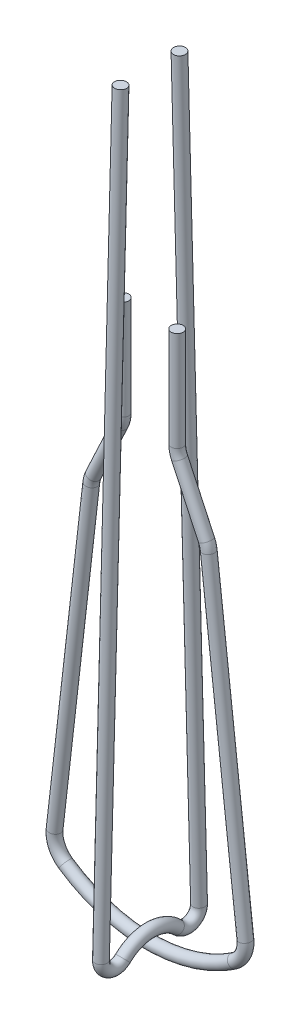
ISO-10303-21;
HEADER;
FILE_DESCRIPTION(('STEP AP214'),'2;1');
FILE_NAME('part.step','',(''),(''),'','','');
FILE_SCHEMA(('AUTOMOTIVE_DESIGN { 1 0 10303 214 1 1 1 1 }'));
ENDSEC;
DATA;
#1=APPLICATION_CONTEXT('core data for automotive mechanical design processes');
#2=APPLICATION_PROTOCOL_DEFINITION('international standard','automotive_design',2000,#1);
#3=PRODUCT_CONTEXT('',#1,'mechanical');
#4=PRODUCT('Part','Part','',(#3));
#5=PRODUCT_RELATED_PRODUCT_CATEGORY('part','',(#4));
#6=PRODUCT_DEFINITION_FORMATION('','',#4);
#7=PRODUCT_DEFINITION_CONTEXT('part definition',#1,'design');
#8=PRODUCT_DEFINITION('design','',#6,#7);
#9=PRODUCT_DEFINITION_SHAPE('','',#8);
#10=(LENGTH_UNIT() NAMED_UNIT(*) SI_UNIT(.MILLI.,.METRE.));
#11=(NAMED_UNIT(*) PLANE_ANGLE_UNIT() SI_UNIT($,.RADIAN.));
#12=(NAMED_UNIT(*) SI_UNIT($,.STERADIAN.) SOLID_ANGLE_UNIT());
#13=UNCERTAINTY_MEASURE_WITH_UNIT(LENGTH_MEASURE(1.E-05),#10,'distance_accuracy_value','');
#14=(GEOMETRIC_REPRESENTATION_CONTEXT(3) GLOBAL_UNCERTAINTY_ASSIGNED_CONTEXT((#13)) GLOBAL_UNIT_ASSIGNED_CONTEXT((#10,
#11,#12)) REPRESENTATION_CONTEXT('',''));
#15=CARTESIAN_POINT('',(0.,0.,0.));
#16=DIRECTION('',(0.,0.,1.));
#17=DIRECTION('',(1.,0.,0.));
#18=AXIS2_PLACEMENT_3D('',#15,#16,#17);
#19=CARTESIAN_POINT('',(6.66749999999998,-5.11109615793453,0.));
#20=DIRECTION('',(0.,1.,0.));
#21=DIRECTION('',(-1.,0.,0.));
#22=AXIS2_PLACEMENT_3D('',#19,#20,#21);
#23=CYLINDRICAL_SURFACE('',#22,1.4605);
#24=CARTESIAN_POINT('',(6.66749999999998,-5.11109615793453,0.));
#25=DIRECTION('',(0.,1.,0.));
#26=DIRECTION('',(-1.,0.,0.));
#27=AXIS2_PLACEMENT_3D('',#24,#25,#26);
#28=CIRCLE('',#27,1.4605);
#29=CARTESIAN_POINT('',(5.20699999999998,-5.11109615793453,0.));
#30=VERTEX_POINT('',#29);
#31=EDGE_CURVE('E49',#30,#30,#28,.T.);
#32=ORIENTED_EDGE('',*,*,#31,.T.);
#33=EDGE_LOOP('',(#32));
#34=FACE_BOUND('',#33,.T.);
#35=CARTESIAN_POINT('',(6.66749999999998,19.2995920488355,0.));
#36=DIRECTION('',(0.,1.,0.));
#37=DIRECTION('',(-1.,0.,0.));
#38=AXIS2_PLACEMENT_3D('',#35,#36,#37);
#39=CIRCLE('',#38,1.4605);
#40=CARTESIAN_POINT('',(5.20699999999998,19.2995920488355,0.));
#41=VERTEX_POINT('',#40);
#42=EDGE_CURVE('E45',#41,#41,#39,.T.);
#43=ORIENTED_EDGE('',*,*,#42,.F.);
#44=EDGE_LOOP('',(#43));
#45=FACE_BOUND('',#44,.T.);
#46=ADVANCED_FACE('F35',(#34,#45),#23,.T.);
#47=CARTESIAN_POINT('',(13.0175,-5.11109615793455,0.));
#48=DIRECTION('',(0.,0.,-1.));
#49=DIRECTION('',(-1.,0.,0.));
#50=AXIS2_PLACEMENT_3D('',#47,#48,#49);
#51=TOROIDAL_SURFACE('',#50,6.35000000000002,1.4605);
#52=CARTESIAN_POINT('',(7.26244555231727,-7.79472211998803,0.));
#53=DIRECTION('',(-0.422618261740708,0.906307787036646,0.));
#54=DIRECTION('',(-0.906307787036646,-0.422618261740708,0.));
#55=AXIS2_PLACEMENT_3D('',#52,#53,#54);
#56=CIRCLE('',#55,1.4605);
#57=CARTESIAN_POINT('',(5.93878302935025,-8.41195609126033,0.));
#58=VERTEX_POINT('',#57);
#59=EDGE_CURVE('E53',#58,#58,#56,.T.);
#60=CARTESIAN_POINT('',(13.0175,-5.11109615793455,0.));
#61=DIRECTION('',(0.,0.,-1.));
#62=DIRECTION('',(-1.,0.,0.));
#63=AXIS2_PLACEMENT_3D('',#60,#61,#62);
#64=CIRCLE('',#63,7.81050000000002);
#65=EDGE_CURVE('',#58,#30,#64,.T.);
#66=ORIENTED_EDGE('',*,*,#59,.T.);
#67=ORIENTED_EDGE('',*,*,#31,.F.);
#68=ORIENTED_EDGE('',*,*,#65,.T.);
#69=ORIENTED_EDGE('',*,*,#65,.F.);
#70=EDGE_LOOP('',(#66,#68,#67,#69));
#71=FACE_BOUND('',#70,.T.);
#72=ADVANCED_FACE('F122',(#71),#51,.T.);
#73=CARTESIAN_POINT('',(13.8521167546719,-21.9263176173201,0.));
#74=DIRECTION('',(-0.422618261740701,0.906307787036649,0.));
#75=DIRECTION('',(-0.906307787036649,-0.422618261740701,0.));
#76=AXIS2_PLACEMENT_3D('',#73,#74,#75);
#77=CYLINDRICAL_SURFACE('',#76,1.4605);
#78=CARTESIAN_POINT('',(13.8521167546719,-21.9263176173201,0.));
#79=DIRECTION('',(-0.422618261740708,0.906307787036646,0.));
#80=DIRECTION('',(-0.906307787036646,-0.422618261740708,0.));
#81=AXIS2_PLACEMENT_3D('',#78,#79,#80);
#82=CIRCLE('',#81,1.4605);
#83=CARTESIAN_POINT('',(15.1757792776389,-21.3090836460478,0.));
#84=VERTEX_POINT('',#83);
#85=EDGE_CURVE('E58',#84,#84,#82,.T.);
#86=ORIENTED_EDGE('',*,*,#85,.T.);
#87=EDGE_LOOP('',(#86));
#88=FACE_BOUND('',#87,.T.);
#89=ORIENTED_EDGE('',*,*,#59,.F.);
#90=EDGE_LOOP('',(#89));
#91=FACE_BOUND('',#90,.T.);
#92=ADVANCED_FACE('F127',(#88,#91),#77,.T.);
#93=CARTESIAN_POINT('',(8.09706230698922,-24.6099435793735,0.));
#94=DIRECTION('',(0.,0.,1.));
#95=DIRECTION('',(1.,0.,0.));
#96=AXIS2_PLACEMENT_3D('',#93,#94,#95);
#97=TOROIDAL_SURFACE('',#96,6.34999999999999,1.4605);
#98=CARTESIAN_POINT('',(14.4053657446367,-23.8834398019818,0.));
#99=DIRECTION('',(-0.114410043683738,0.993433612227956,0.));
#100=DIRECTION('',(-0.993433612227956,-0.114410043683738,0.));
#101=AXIS2_PLACEMENT_3D('',#98,#99,#100);
#102=CIRCLE('',#101,1.4605);
#103=CARTESIAN_POINT('',(15.8562755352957,-23.7163439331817,0.));
#104=VERTEX_POINT('',#103);
#105=EDGE_CURVE('E61',#104,#104,#102,.T.);
#106=CARTESIAN_POINT('',(8.09706230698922,-24.6099435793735,0.));
#107=DIRECTION('',(0.,0.,1.));
#108=DIRECTION('',(1.,0.,0.));
#109=AXIS2_PLACEMENT_3D('',#106,#107,#108);
#110=CIRCLE('',#109,7.81049999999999);
#111=EDGE_CURVE('',#104,#84,#110,.T.);
#112=ORIENTED_EDGE('',*,*,#105,.T.);
#113=ORIENTED_EDGE('',*,*,#85,.F.);
#114=ORIENTED_EDGE('',*,*,#111,.T.);
#115=ORIENTED_EDGE('',*,*,#111,.F.);
#116=EDGE_LOOP('',(#112,#114,#113,#115));
#117=FACE_BOUND('',#116,.T.);
#118=ADVANCED_FACE('F135',(#117),#97,.T.);
#119=CARTESIAN_POINT('',(23.3995437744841,-101.980768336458,0.));
#120=DIRECTION('',(-0.114410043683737,0.993433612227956,0.));
#121=DIRECTION('',(-0.993433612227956,-0.114410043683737,0.));
#122=AXIS2_PLACEMENT_3D('',#119,#120,#121);
#123=CYLINDRICAL_SURFACE('',#122,1.4605);
#124=CARTESIAN_POINT('',(23.3995437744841,-101.980768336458,0.));
#125=DIRECTION('',(-0.114410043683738,0.993433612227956,0.));
#126=DIRECTION('',(-0.993433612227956,-0.114410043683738,0.));
#127=AXIS2_PLACEMENT_3D('',#124,#125,#126);
#128=CIRCLE('',#127,1.4605);
#129=CARTESIAN_POINT('',(24.850453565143,-101.813672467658,0.));
#130=VERTEX_POINT('',#129);
#131=EDGE_CURVE('E64',#130,#130,#128,.T.);
#132=ORIENTED_EDGE('',*,*,#131,.T.);
#133=EDGE_LOOP('',(#132));
#134=FACE_BOUND('',#133,.T.);
#135=ORIENTED_EDGE('',*,*,#105,.F.);
#136=EDGE_LOOP('',(#135));
#137=FACE_BOUND('',#136,.T.);
#138=ADVANCED_FACE('F141',(#134,#137),#123,.T.);
#139=CARTESIAN_POINT('',(17.0912403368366,-102.70727211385,0.));
#140=DIRECTION('',(0.,0.,1.));
#141=DIRECTION('',(1.,0.,0.));
#142=AXIS2_PLACEMENT_3D('',#139,#140,#141);
#143=TOROIDAL_SURFACE('',#142,6.35,1.4605);
#144=CARTESIAN_POINT('',(20.6519154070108,-107.965037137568,0.));
#145=DIRECTION('',(0.8279944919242,0.560736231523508,0.));
#146=DIRECTION('',(-0.560736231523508,0.8279944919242,0.));
#147=AXIS2_PLACEMENT_3D('',#144,#145,#146);
#148=CIRCLE('',#147,1.4605);
#149=CARTESIAN_POINT('',(21.4708706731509,-109.174323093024,0.));
#150=VERTEX_POINT('',#149);
#151=EDGE_CURVE('E67',#150,#150,#148,.T.);
#152=CARTESIAN_POINT('',(17.0912403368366,-102.70727211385,0.));
#153=DIRECTION('',(0.,0.,1.));
#154=DIRECTION('',(1.,0.,0.));
#155=AXIS2_PLACEMENT_3D('',#152,#153,#154);
#156=CIRCLE('',#155,7.8105);
#157=EDGE_CURVE('',#150,#130,#156,.T.);
#158=ORIENTED_EDGE('',*,*,#151,.T.);
#159=ORIENTED_EDGE('',*,*,#131,.F.);
#160=ORIENTED_EDGE('',*,*,#157,.T.);
#161=ORIENTED_EDGE('',*,*,#157,.F.);
#162=EDGE_LOOP('',(#158,#160,#159,#161));
#163=FACE_BOUND('',#162,.T.);
#164=ADVANCED_FACE('F145',(#163),#143,.T.);
#165=CARTESIAN_POINT('',(0.,-77.47,0.));
#166=DIRECTION('',(0.,0.,1.));
#167=DIRECTION('',(1.,0.,0.));
#168=AXIS2_PLACEMENT_3D('',#165,#166,#167);
#169=TOROIDAL_SURFACE('',#168,36.83,1.4605);
#170=CARTESIAN_POINT('',(-0.651045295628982,-113.11229995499,-0.858205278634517));
#171=CARTESIAN_POINT('',(-0.69147082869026,-113.088762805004,-0.826812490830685));
#172=CARTESIAN_POINT('',(-0.72846681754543,-113.064384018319,-0.791627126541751));
#173=CARTESIAN_POINT('',(-0.795055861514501,-113.016457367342,-0.71436035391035));
#174=CARTESIAN_POINT('',(-0.824646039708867,-112.992909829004,-0.67227627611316));
#175=CARTESIAN_POINT('',(-0.876399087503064,-112.948958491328,-0.582504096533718));
#176=CARTESIAN_POINT('',(-0.898581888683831,-112.928546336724,-0.534831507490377));
#177=CARTESIAN_POINT('',(-0.93605397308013,-112.892480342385,-0.435182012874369));
#178=CARTESIAN_POINT('',(-0.951342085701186,-112.876827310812,-0.383204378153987));
#179=CARTESIAN_POINT('',(-0.975632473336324,-112.851290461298,-0.275934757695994));
#180=CARTESIAN_POINT('',(-0.984577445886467,-112.841459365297,-0.220617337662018));
#181=CARTESIAN_POINT('',(-0.996345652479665,-112.82841459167,-0.108568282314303));
#182=CARTESIAN_POINT('',(-0.999167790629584,-112.825202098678,-0.0518363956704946));
#183=CARTESIAN_POINT('',(-0.998815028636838,-112.825601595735,0.064265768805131));
#184=CARTESIAN_POINT('',(-0.995351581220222,-112.829541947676,0.123634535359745));
#185=CARTESIAN_POINT('',(-0.98167694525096,-112.844640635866,0.240664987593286));
#186=CARTESIAN_POINT('',(-0.971464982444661,-112.855799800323,0.298326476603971));
#187=CARTESIAN_POINT('',(-0.943810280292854,-112.884550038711,0.410268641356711));
#188=CARTESIAN_POINT('',(-0.926362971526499,-112.902145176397,0.464547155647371));
#189=CARTESIAN_POINT('',(-0.883640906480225,-112.94231691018,0.567933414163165));
#190=CARTESIAN_POINT('',(-0.858369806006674,-112.964891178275,0.617043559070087));
#191=CARTESIAN_POINT('',(-0.800965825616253,-113.011722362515,0.706354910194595));
#192=CARTESIAN_POINT('',(-0.769211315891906,-113.035850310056,0.746866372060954));
#193=CARTESIAN_POINT('',(-0.698307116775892,-113.084263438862,0.820679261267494));
#194=CARTESIAN_POINT('',(-0.65916067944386,-113.108548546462,0.85398384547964));
#195=CARTESIAN_POINT('',(-0.576840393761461,-113.153296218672,0.911020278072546));
#196=CARTESIAN_POINT('',(-0.534065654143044,-113.173902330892,0.935216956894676));
#197=CARTESIAN_POINT('',(-0.443725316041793,-113.211126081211,0.97678105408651));
#198=CARTESIAN_POINT('',(-0.396159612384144,-113.227743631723,0.994148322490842));
#199=CARTESIAN_POINT('',(-0.298777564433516,-113.255228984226,1.02196551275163));
#200=CARTESIAN_POINT('',(-0.249039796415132,-113.266222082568,1.03256760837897));
#201=CARTESIAN_POINT('',(-0.147713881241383,-113.28220430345,1.04776778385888));
#202=CARTESIAN_POINT('',(-0.09612556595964,-113.287192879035,1.0523653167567));
#203=CARTESIAN_POINT('',(0.00789937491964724,-113.290821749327,1.05572288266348));
#204=CARTESIAN_POINT('',(0.0603394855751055,-113.289408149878,1.05443335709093));
#205=CARTESIAN_POINT('',(0.164160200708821,-113.280210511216,1.04585736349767));
#206=CARTESIAN_POINT('',(0.215540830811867,-113.272426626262,1.03857104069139));
#207=CARTESIAN_POINT('',(0.315922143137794,-113.251036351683,1.01774229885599));
#208=CARTESIAN_POINT('',(0.364915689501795,-113.237413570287,1.00418225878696));
#209=CARTESIAN_POINT('',(0.458942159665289,-113.205442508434,0.970513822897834));
#210=CARTESIAN_POINT('',(0.503975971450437,-113.187095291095,0.950406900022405));
#211=CARTESIAN_POINT('',(0.588459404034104,-113.147462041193,0.903725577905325));
#212=CARTESIAN_POINT('',(0.627958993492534,-113.126206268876,0.877215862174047));
#213=CARTESIAN_POINT('',(0.701049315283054,-113.082510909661,0.817809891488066));
#214=CARTESIAN_POINT('',(0.734640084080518,-113.060071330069,0.784913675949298));
#215=CARTESIAN_POINT('',(0.795729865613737,-113.015825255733,0.713073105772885));
#216=CARTESIAN_POINT('',(0.823187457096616,-112.994023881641,0.674090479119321));
#217=CARTESIAN_POINT('',(0.871778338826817,-112.952992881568,0.591150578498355));
#218=CARTESIAN_POINT('',(0.892909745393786,-112.933764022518,0.54719182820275));
#219=CARTESIAN_POINT('',(0.930038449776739,-112.898450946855,0.453200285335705));
#220=CARTESIAN_POINT('',(0.9457391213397,-112.882563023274,0.40297683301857));
#221=CARTESIAN_POINT('',(0.971006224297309,-112.856257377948,0.299636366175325));
#222=CARTESIAN_POINT('',(0.980570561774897,-112.845841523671,0.246518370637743));
#223=CARTESIAN_POINT('',(0.994339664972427,-112.830677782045,0.135471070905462));
#224=CARTESIAN_POINT('',(0.998185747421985,-112.826310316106,0.0774449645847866));
#225=CARTESIAN_POINT('',(0.999587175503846,-112.824729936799,-0.038788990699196));
#226=CARTESIAN_POINT('',(0.997140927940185,-112.827518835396,-0.0969968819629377));
#227=CARTESIAN_POINT('',(0.985671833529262,-112.840258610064,-0.213653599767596));
#228=CARTESIAN_POINT('',(0.976465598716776,-112.85040909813,-0.272062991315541));
#229=CARTESIAN_POINT('',(0.950825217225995,-112.87737607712,-0.385676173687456));
#230=CARTESIAN_POINT('',(0.934392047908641,-112.894191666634,-0.4408803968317));
#231=CARTESIAN_POINT('',(0.894112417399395,-112.932719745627,-0.545242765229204));
#232=CARTESIAN_POINT('',(0.870425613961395,-112.95432424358,-0.594502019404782));
#233=CARTESIAN_POINT('',(0.81509011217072,-113.00063795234,-0.686675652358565));
#234=CARTESIAN_POINT('',(0.783446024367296,-113.025345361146,-0.729593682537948));
#235=CARTESIAN_POINT('',(0.714356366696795,-113.073790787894,-0.805500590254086));
#236=CARTESIAN_POINT('',(0.677374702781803,-113.097497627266,-0.838931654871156));
#237=CARTESIAN_POINT('',(0.596966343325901,-113.143039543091,-0.898532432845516));
#238=CARTESIAN_POINT('',(0.553541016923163,-113.164875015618,-0.924703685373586));
#239=CARTESIAN_POINT('',(0.463682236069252,-113.203528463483,-0.968572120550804));
#240=CARTESIAN_POINT('',(0.417506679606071,-113.220542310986,-0.986626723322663));
#241=CARTESIAN_POINT('',(0.321634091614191,-113.249505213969,-1.01632023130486));
#242=CARTESIAN_POINT('',(0.271936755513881,-113.26145383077,-1.02795858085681));
#243=CARTESIAN_POINT('',(0.170713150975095,-113.279304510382,-1.04505807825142));
#244=CARTESIAN_POINT('',(0.119197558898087,-113.285237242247,-1.05055057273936));
#245=CARTESIAN_POINT('',(0.0155371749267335,-113.290736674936,-1.05564797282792));
#246=CARTESIAN_POINT('',(-0.0366076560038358,-113.290302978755,-1.05525251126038));
#247=CARTESIAN_POINT('',(-0.140564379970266,-113.283064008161,-1.04852686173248));
#248=CARTESIAN_POINT('',(-0.192368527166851,-113.276198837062,-1.04214088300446));
#249=CARTESIAN_POINT('',(-0.293650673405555,-113.256520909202,-1.02314635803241));
#250=CARTESIAN_POINT('',(-0.343128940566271,-113.243708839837,-1.01053853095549));
#251=CARTESIAN_POINT('',(-0.438773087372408,-113.213015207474,-0.978660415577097));
#252=CARTESIAN_POINT('',(-0.484904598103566,-113.19508842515,-0.959330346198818));
#253=CARTESIAN_POINT('',(-0.572048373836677,-113.155788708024,-0.913851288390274));
#254=CARTESIAN_POINT('',(-0.613060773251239,-113.13441586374,-0.887702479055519));
#255=CARTESIAN_POINT('',(-0.651045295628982,-113.11229995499,-0.858205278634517));
#256=B_SPLINE_CURVE_WITH_KNOTS('',3,(#170,#171,#172,#173,#174,#175,#176,#177,#178,#179,#180,
#181,#182,#183,#184,#185,#186,#187,#188,#189,#190,#191,#192,#193,#194,#195,#196,#197,#198,#199,
#200,#201,#202,#203,#204,#205,#206,#207,#208,#209,#210,#211,#212,#213,#214,#215,#216,#217,#218,
#219,#220,#221,#222,#223,#224,#225,#226,#227,#228,#229,#230,#231,#232,#233,#234,#235,#236,#237,
#238,#239,#240,#241,#242,#243,#244,#245,#246,#247,#248,#249,#250,#251,#252,#253,#254,#255),
.UNSPECIFIED.,.T.,.F.,(4,2,2,2,2,2,2,2,2,2,2,2,2,2,2,2,2,2,2,2,2,2,2,2,2,2,2,2,2,2,2,2,2,2,2,2,
2,2,2,2,2,2,4),(0.,0.168791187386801,0.337647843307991,0.506046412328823,0.674473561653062,
0.844403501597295,1.01436385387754,1.19232461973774,1.37030580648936,1.54839956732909,
1.72641023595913,1.89605358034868,2.06562246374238,2.22469850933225,2.3837780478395,
2.539139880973,2.6945158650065,2.85120223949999,3.00788481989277,3.16501017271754,
3.32210019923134,3.47766514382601,3.63322912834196,3.78981394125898,3.94644533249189,
4.11062786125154,4.27486638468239,4.44902675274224,4.62323122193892,4.80234482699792,
4.98143421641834,5.15683502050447,5.33213442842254,5.49688122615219,5.66159306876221,
5.81809335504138,5.97460719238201,6.13031904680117,6.2860406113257,6.44322699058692,
6.60039520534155,6.75899845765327,6.91759754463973),.UNSPECIFIED.);
#257=CARTESIAN_POINT('',(-0.651045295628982,-113.11229995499,-0.858205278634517));
#258=VERTEX_POINT('',#257);
#259=EDGE_CURVE('E10',#258,#258,#256,.T.);
#260=ORIENTED_EDGE('',*,*,#259,.F.);
#261=EDGE_LOOP('',(#260));
#262=FACE_BOUND('',#261,.T.);
#263=CARTESIAN_POINT('',(-20.6519154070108,-107.965037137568,0.));
#264=DIRECTION('',(0.827994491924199,-0.56073623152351,0.));
#265=DIRECTION('',(0.56073623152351,0.827994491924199,0.));
#266=AXIS2_PLACEMENT_3D('',#263,#264,#265);
#267=CIRCLE('',#266,1.4605);
#268=CARTESIAN_POINT('',(-21.4708706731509,-109.174323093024,0.));
#269=VERTEX_POINT('',#268);
#270=EDGE_CURVE('E70',#269,#269,#267,.T.);
#271=ORIENTED_EDGE('',*,*,#270,.T.);
#272=EDGE_LOOP('',(#271));
#273=FACE_BOUND('',#272,.T.);
#274=ORIENTED_EDGE('',*,*,#151,.F.);
#275=EDGE_LOOP('',(#274));
#276=FACE_BOUND('',#275,.T.);
#277=ADVANCED_FACE('F148',(#262,#273,#276),#169,.T.);
#278=CARTESIAN_POINT('',(-17.0912403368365,-102.70727211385,0.));
#279=DIRECTION('',(0.,0.,1.));
#280=DIRECTION('',(1.,0.,0.));
#281=AXIS2_PLACEMENT_3D('',#278,#279,#280);
#282=TOROIDAL_SURFACE('',#281,6.34999999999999,1.4605);
#283=CARTESIAN_POINT('',(-23.3995437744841,-101.980768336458,0.));
#284=DIRECTION('',(-0.114410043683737,-0.993433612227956,0.));
#285=DIRECTION('',(0.993433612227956,-0.114410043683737,0.));
#286=AXIS2_PLACEMENT_3D('',#283,#284,#285);
#287=CIRCLE('',#286,1.4605);
#288=CARTESIAN_POINT('',(-24.850453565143,-101.813672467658,0.));
#289=VERTEX_POINT('',#288);
#290=EDGE_CURVE('E73',#289,#289,#287,.T.);
#291=CARTESIAN_POINT('',(-17.0912403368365,-102.70727211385,0.));
#292=DIRECTION('',(0.,0.,1.));
#293=DIRECTION('',(1.,0.,0.));
#294=AXIS2_PLACEMENT_3D('',#291,#292,#293);
#295=CIRCLE('',#294,7.81049999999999);
#296=EDGE_CURVE('',#289,#269,#295,.T.);
#297=ORIENTED_EDGE('',*,*,#290,.T.);
#298=ORIENTED_EDGE('',*,*,#270,.F.);
#299=ORIENTED_EDGE('',*,*,#296,.T.);
#300=ORIENTED_EDGE('',*,*,#296,.F.);
#301=EDGE_LOOP('',(#297,#299,#298,#300));
#302=FACE_BOUND('',#301,.T.);
#303=ADVANCED_FACE('F153',(#302),#282,.T.);
#304=CARTESIAN_POINT('',(-14.4053657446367,-23.8834398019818,0.));
#305=DIRECTION('',(-0.114410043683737,-0.993433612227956,0.));
#306=DIRECTION('',(0.993433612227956,-0.114410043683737,0.));
#307=AXIS2_PLACEMENT_3D('',#304,#305,#306);
#308=CYLINDRICAL_SURFACE('',#307,1.4605);
#309=CARTESIAN_POINT('',(-14.4053657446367,-23.8834398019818,0.));
#310=DIRECTION('',(-0.114410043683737,-0.993433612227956,0.));
#311=DIRECTION('',(0.993433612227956,-0.114410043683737,0.));
#312=AXIS2_PLACEMENT_3D('',#309,#310,#311);
#313=CIRCLE('',#312,1.4605);
#314=CARTESIAN_POINT('',(-15.8562755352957,-23.7163439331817,0.));
#315=VERTEX_POINT('',#314);
#316=EDGE_CURVE('E76',#315,#315,#313,.T.);
#317=ORIENTED_EDGE('',*,*,#316,.T.);
#318=EDGE_LOOP('',(#317));
#319=FACE_BOUND('',#318,.T.);
#320=ORIENTED_EDGE('',*,*,#290,.F.);
#321=EDGE_LOOP('',(#320));
#322=FACE_BOUND('',#321,.T.);
#323=ADVANCED_FACE('F157',(#319,#322),#308,.T.);
#324=CARTESIAN_POINT('',(-8.09706230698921,-24.6099435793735,0.));
#325=DIRECTION('',(0.,0.,1.));
#326=DIRECTION('',(1.,0.,0.));
#327=AXIS2_PLACEMENT_3D('',#324,#325,#326);
#328=TOROIDAL_SURFACE('',#327,6.35,1.4605);
#329=CARTESIAN_POINT('',(-13.8521167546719,-21.92631761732,0.));
#330=DIRECTION('',(-0.422618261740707,-0.906307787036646,0.));
#331=DIRECTION('',(0.906307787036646,-0.422618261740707,0.));
#332=AXIS2_PLACEMENT_3D('',#329,#330,#331);
#333=CIRCLE('',#332,1.4605);
#334=CARTESIAN_POINT('',(-15.1757792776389,-21.3090836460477,0.));
#335=VERTEX_POINT('',#334);
#336=EDGE_CURVE('E79',#335,#335,#333,.T.);
#337=CARTESIAN_POINT('',(-8.09706230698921,-24.6099435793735,0.));
#338=DIRECTION('',(0.,0.,1.));
#339=DIRECTION('',(1.,0.,0.));
#340=AXIS2_PLACEMENT_3D('',#337,#338,#339);
#341=CIRCLE('',#340,7.8105);
#342=EDGE_CURVE('',#335,#315,#341,.T.);
#343=ORIENTED_EDGE('',*,*,#336,.T.);
#344=ORIENTED_EDGE('',*,*,#316,.F.);
#345=ORIENTED_EDGE('',*,*,#342,.T.);
#346=ORIENTED_EDGE('',*,*,#342,.F.);
#347=EDGE_LOOP('',(#343,#345,#344,#346));
#348=FACE_BOUND('',#347,.T.);
#349=ADVANCED_FACE('F161',(#348),#328,.T.);
#350=CARTESIAN_POINT('',(-7.26244555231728,-7.79472211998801,0.));
#351=DIRECTION('',(-0.422618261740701,-0.906307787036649,0.));
#352=DIRECTION('',(0.906307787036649,-0.422618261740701,0.));
#353=AXIS2_PLACEMENT_3D('',#350,#351,#352);
#354=CYLINDRICAL_SURFACE('',#353,1.4605);
#355=CARTESIAN_POINT('',(-7.26244555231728,-7.79472211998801,0.));
#356=DIRECTION('',(-0.422618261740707,-0.906307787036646,0.));
#357=DIRECTION('',(0.906307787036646,-0.422618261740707,0.));
#358=AXIS2_PLACEMENT_3D('',#355,#356,#357);
#359=CIRCLE('',#358,1.4605);
#360=CARTESIAN_POINT('',(-5.93878302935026,-8.41195609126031,0.));
#361=VERTEX_POINT('',#360);
#362=EDGE_CURVE('E82',#361,#361,#359,.T.);
#363=ORIENTED_EDGE('',*,*,#362,.T.);
#364=EDGE_LOOP('',(#363));
#365=FACE_BOUND('',#364,.T.);
#366=ORIENTED_EDGE('',*,*,#336,.F.);
#367=EDGE_LOOP('',(#366));
#368=FACE_BOUND('',#367,.T.);
#369=ADVANCED_FACE('F165',(#365,#368),#354,.T.);
#370=CARTESIAN_POINT('',(-13.0175,-5.11109615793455,0.));
#371=DIRECTION('',(0.,0.,-1.));
#372=DIRECTION('',(-1.,0.,0.));
#373=AXIS2_PLACEMENT_3D('',#370,#371,#372);
#374=TOROIDAL_SURFACE('',#373,6.35,1.4605);
#375=CARTESIAN_POINT('',(-6.6675,-5.11109615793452,0.));
#376=DIRECTION('',(0.,-1.,0.));
#377=DIRECTION('',(1.,0.,0.));
#378=AXIS2_PLACEMENT_3D('',#375,#376,#377);
#379=CIRCLE('',#378,1.4605);
#380=CARTESIAN_POINT('',(-5.207,-5.11109615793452,0.));
#381=VERTEX_POINT('',#380);
#382=EDGE_CURVE('E85',#381,#381,#379,.T.);
#383=CARTESIAN_POINT('',(-13.0175,-5.11109615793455,0.));
#384=DIRECTION('',(0.,0.,-1.));
#385=DIRECTION('',(-1.,0.,0.));
#386=AXIS2_PLACEMENT_3D('',#383,#384,#385);
#387=CIRCLE('',#386,7.8105);
#388=EDGE_CURVE('',#381,#361,#387,.T.);
#389=ORIENTED_EDGE('',*,*,#382,.T.);
#390=ORIENTED_EDGE('',*,*,#362,.F.);
#391=ORIENTED_EDGE('',*,*,#388,.T.);
#392=ORIENTED_EDGE('',*,*,#388,.F.);
#393=EDGE_LOOP('',(#389,#391,#390,#392));
#394=FACE_BOUND('',#393,.T.);
#395=ADVANCED_FACE('F169',(#394),#374,.T.);
#396=CARTESIAN_POINT('',(-6.6675,-5.11109615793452,0.));
#397=DIRECTION('',(0.,1.,0.));
#398=DIRECTION('',(-1.,0.,0.));
#399=AXIS2_PLACEMENT_3D('',#396,#397,#398);
#400=CYLINDRICAL_SURFACE('',#399,1.4605);
#401=ORIENTED_EDGE('',*,*,#382,.F.);
#402=EDGE_LOOP('',(#401));
#403=FACE_BOUND('',#402,.T.);
#404=CARTESIAN_POINT('',(-6.6675,19.2995920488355,0.));
#405=DIRECTION('',(0.,-1.,0.));
#406=DIRECTION('',(1.,0.,0.));
#407=AXIS2_PLACEMENT_3D('',#404,#405,#406);
#408=CIRCLE('',#407,1.4605);
#409=CARTESIAN_POINT('',(-5.207,19.2995920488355,0.));
#410=VERTEX_POINT('',#409);
#411=EDGE_CURVE('E88',#410,#410,#408,.T.);
#412=ORIENTED_EDGE('',*,*,#411,.T.);
#413=EDGE_LOOP('',(#412));
#414=FACE_BOUND('',#413,.T.);
#415=ADVANCED_FACE('F173',(#403,#414),#400,.T.);
#416=CARTESIAN_POINT('',(6.66749999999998,19.2995920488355,0.));
#417=DIRECTION('',(0.,1.,0.));
#418=DIRECTION('',(-1.,0.,0.));
#419=AXIS2_PLACEMENT_3D('',#416,#417,#418);
#420=PLANE('',#419);
#421=ORIENTED_EDGE('',*,*,#42,.T.);
#422=EDGE_LOOP('',(#421));
#423=FACE_BOUND('',#422,.T.);
#424=ADVANCED_FACE('F177',(#423),#420,.T.);
#425=CARTESIAN_POINT('',(-6.6675,19.2995920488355,0.));
#426=DIRECTION('',(0.,-1.,0.));
#427=DIRECTION('',(1.,0.,0.));
#428=AXIS2_PLACEMENT_3D('',#425,#426,#427);
#429=PLANE('',#428);
#430=ORIENTED_EDGE('',*,*,#411,.F.);
#431=EDGE_LOOP('',(#430));
#432=FACE_BOUND('',#431,.T.);
#433=ADVANCED_FACE('F181',(#432),#429,.F.);
#434=CARTESIAN_POINT('',(0.,-112.103356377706,-12.0343137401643));
#435=DIRECTION('',(0.,0.999657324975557,0.0261769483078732));
#436=DIRECTION('',(0.,-0.0261769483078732,0.999657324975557));
#437=AXIS2_PLACEMENT_3D('',#434,#435,#436);
#438=CYLINDRICAL_SURFACE('',#437,1.4605);
#439=CARTESIAN_POINT('',(0.,-112.103356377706,-12.0343137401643));
#440=DIRECTION('',(0.,0.999657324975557,0.0261769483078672));
#441=DIRECTION('',(0.,-0.0261769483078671,0.999657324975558));
#442=AXIS2_PLACEMENT_3D('',#439,#440,#441);
#443=CIRCLE('',#442,1.4605);
#444=CARTESIAN_POINT('',(0.,-112.065124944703,-13.4943132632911));
#445=VERTEX_POINT('',#444);
#446=EDGE_CURVE('E94',#445,#445,#443,.T.);
#447=ORIENTED_EDGE('',*,*,#446,.T.);
#448=EDGE_LOOP('',(#447));
#449=FACE_BOUND('',#448,.T.);
#450=CARTESIAN_POINT('',(0.,71.374,-7.22979007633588));
#451=DIRECTION('',(0.,0.999657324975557,0.0261769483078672));
#452=DIRECTION('',(0.,-0.0261769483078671,0.999657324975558));
#453=AXIS2_PLACEMENT_3D('',#450,#451,#452);
#454=CIRCLE('',#453,1.4605);
#455=CARTESIAN_POINT('',(0.,71.3357685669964,-5.76979055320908));
#456=VERTEX_POINT('',#455);
#457=EDGE_CURVE('E91',#456,#456,#454,.T.);
#458=ORIENTED_EDGE('',*,*,#457,.F.);
#459=EDGE_LOOP('',(#458));
#460=FACE_BOUND('',#459,.T.);
#461=ADVANCED_FACE('F184',(#449,#460),#438,.T.);
#462=CARTESIAN_POINT('',(0.,-112.186468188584,-8.86040173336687));
#463=DIRECTION('',(1.,0.,0.));
#464=DIRECTION('',(0.,0.,-1.));
#465=AXIS2_PLACEMENT_3D('',#462,#463,#464);
#466=TOROIDAL_SURFACE('',#465,3.175,1.4605);
#467=CARTESIAN_POINT('',(0.,-114.461101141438,-6.64530130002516));
#468=DIRECTION('',(0.,-0.697669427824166,-0.716419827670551));
#469=DIRECTION('',(0.,0.716419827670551,-0.697669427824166));
#470=AXIS2_PLACEMENT_3D('',#467,#468,#469);
#471=CIRCLE('',#470,1.4605);
#472=CARTESIAN_POINT('',(0.,-115.507432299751,-5.62635510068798));
#473=VERTEX_POINT('',#472);
#474=EDGE_CURVE('E97',#473,#473,#471,.T.);
#475=CARTESIAN_POINT('',(0.,-112.186468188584,-8.86040173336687));
#476=DIRECTION('',(1.,0.,0.));
#477=DIRECTION('',(0.,0.,-1.));
#478=AXIS2_PLACEMENT_3D('',#475,#476,#477);
#479=CIRCLE('',#478,4.6355);
#480=EDGE_CURVE('',#473,#445,#479,.T.);
#481=ORIENTED_EDGE('',*,*,#474,.T.);
#482=ORIENTED_EDGE('',*,*,#446,.F.);
#483=ORIENTED_EDGE('',*,*,#480,.T.);
#484=ORIENTED_EDGE('',*,*,#480,.F.);
#485=EDGE_LOOP('',(#481,#483,#482,#484));
#486=FACE_BOUND('',#485,.T.);
#487=ADVANCED_FACE('F188',(#486),#466,.T.);
#488=CARTESIAN_POINT('',(0.,-121.285,0.));
#489=DIRECTION('',(-1.,0.,0.));
#490=DIRECTION('',(0.,0.,1.));
#491=AXIS2_PLACEMENT_3D('',#488,#489,#490);
#492=TOROIDAL_SURFACE('',#491,9.525,1.4605);
#493=ORIENTED_EDGE('',*,*,#259,.T.);
#494=EDGE_LOOP('',(#493));
#495=FACE_BOUND('',#494,.T.);
#496=CARTESIAN_POINT('',(0.,-114.461101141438,6.64530130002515));
#497=DIRECTION('',(0.,0.697669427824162,-0.716419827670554));
#498=DIRECTION('',(0.,0.716419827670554,0.697669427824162));
#499=AXIS2_PLACEMENT_3D('',#496,#497,#498);
#500=CIRCLE('',#499,1.4605);
#501=CARTESIAN_POINT('',(0.,-115.507432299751,5.62635510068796));
#502=VERTEX_POINT('',#501);
#503=EDGE_CURVE('E100',#502,#502,#500,.T.);
#504=ORIENTED_EDGE('',*,*,#503,.T.);
#505=EDGE_LOOP('',(#504));
#506=FACE_BOUND('',#505,.T.);
#507=ORIENTED_EDGE('',*,*,#474,.F.);
#508=EDGE_LOOP('',(#507));
#509=FACE_BOUND('',#508,.T.);
#510=ADVANCED_FACE('F191',(#495,#506,#509),#492,.T.);
#511=CARTESIAN_POINT('',(0.,-112.186468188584,8.86040173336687));
#512=DIRECTION('',(1.,0.,0.));
#513=DIRECTION('',(0.,0.,-1.));
#514=AXIS2_PLACEMENT_3D('',#511,#512,#513);
#515=TOROIDAL_SURFACE('',#514,3.175,1.4605);
#516=CARTESIAN_POINT('',(0.,-112.103356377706,12.0343137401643));
#517=DIRECTION('',(0.,-0.999657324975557,0.0261769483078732));
#518=DIRECTION('',(0.,-0.0261769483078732,-0.999657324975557));
#519=AXIS2_PLACEMENT_3D('',#516,#517,#518);
#520=CIRCLE('',#519,1.4605);
#521=CARTESIAN_POINT('',(0.,-112.065124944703,13.4943132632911));
#522=VERTEX_POINT('',#521);
#523=EDGE_CURVE('E103',#522,#522,#520,.T.);
#524=CARTESIAN_POINT('',(0.,-112.186468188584,8.86040173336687));
#525=DIRECTION('',(1.,0.,0.));
#526=DIRECTION('',(0.,0.,-1.));
#527=AXIS2_PLACEMENT_3D('',#524,#525,#526);
#528=CIRCLE('',#527,4.6355);
#529=EDGE_CURVE('',#522,#502,#528,.T.);
#530=ORIENTED_EDGE('',*,*,#523,.T.);
#531=ORIENTED_EDGE('',*,*,#503,.F.);
#532=ORIENTED_EDGE('',*,*,#529,.T.);
#533=ORIENTED_EDGE('',*,*,#529,.F.);
#534=EDGE_LOOP('',(#530,#532,#531,#533));
#535=FACE_BOUND('',#534,.T.);
#536=ADVANCED_FACE('F196',(#535),#515,.T.);
#537=CARTESIAN_POINT('',(0.,-112.103356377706,12.0343137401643));
#538=DIRECTION('',(0.,0.999657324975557,-0.0261769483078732));
#539=DIRECTION('',(0.,0.0261769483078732,0.999657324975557));
#540=AXIS2_PLACEMENT_3D('',#537,#538,#539);
#541=CYLINDRICAL_SURFACE('',#540,1.4605);
#542=CARTESIAN_POINT('',(0.,71.374,7.22979007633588));
#543=DIRECTION('',(0.,-0.999657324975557,0.0261769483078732));
#544=DIRECTION('',(0.,-0.0261769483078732,-0.999657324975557));
#545=AXIS2_PLACEMENT_3D('',#542,#543,#544);
#546=CIRCLE('',#545,1.4605);
#547=CARTESIAN_POINT('',(0.,71.4122314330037,8.68978959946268));
#548=VERTEX_POINT('',#547);
#549=EDGE_CURVE('E106',#548,#548,#546,.T.);
#550=CARTESIAN_POINT('',(0.,-112.065124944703,13.4943132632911));
#551=CARTESIAN_POINT('',(0.,-110.153902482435,13.4442661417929));
#552=CARTESIAN_POINT('',(0.,-108.242680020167,13.3942190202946));
#553=CARTESIAN_POINT('',(0.,-104.420235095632,13.2941247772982));
#554=CARTESIAN_POINT('',(0.,-102.509012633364,13.2440776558));
#555=CARTESIAN_POINT('',(0.,-98.6865677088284,13.1439834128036));
#556=CARTESIAN_POINT('',(0.,-96.7753452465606,13.0939362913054));
#557=CARTESIAN_POINT('',(0.,-92.9529003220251,12.9938420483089));
#558=CARTESIAN_POINT('',(0.,-91.0416778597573,12.9437949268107));
#559=CARTESIAN_POINT('',(0.,-87.2192329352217,12.8437006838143));
#560=CARTESIAN_POINT('',(0.,-85.308010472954,12.7936535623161));
#561=CARTESIAN_POINT('',(0.,-81.4855655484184,12.6935593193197));
#562=CARTESIAN_POINT('',(0.,-79.5743430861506,12.6435121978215));
#563=CARTESIAN_POINT('',(0.,-75.7518981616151,12.543417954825));
#564=CARTESIAN_POINT('',(0.,-73.8406756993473,12.4933708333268));
#565=CARTESIAN_POINT('',(0.,-70.0182307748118,12.3932765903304));
#566=CARTESIAN_POINT('',(0.,-68.107008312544,12.3432294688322));
#567=CARTESIAN_POINT('',(0.,-64.2845633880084,12.2431352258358));
#568=CARTESIAN_POINT('',(0.,-62.3733409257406,12.1930881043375));
#569=CARTESIAN_POINT('',(0.,-58.5508960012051,12.0929938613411));
#570=CARTESIAN_POINT('',(0.,-56.6396735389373,12.0429467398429));
#571=CARTESIAN_POINT('',(0.,-52.8172286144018,11.9428524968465));
#572=CARTESIAN_POINT('',(0.,-50.906006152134,11.8928053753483));
#573=CARTESIAN_POINT('',(0.,-47.0835612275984,11.7927111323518));
#574=CARTESIAN_POINT('',(0.,-45.1723387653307,11.7426640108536));
#575=CARTESIAN_POINT('',(0.,-41.3498938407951,11.6425697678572));
#576=CARTESIAN_POINT('',(0.,-39.4386713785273,11.592522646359));
#577=CARTESIAN_POINT('',(0.,-35.6162264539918,11.4924284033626));
#578=CARTESIAN_POINT('',(0.,-33.705003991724,11.4423812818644));
#579=CARTESIAN_POINT('',(0.,-29.8825590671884,11.3422870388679));
#580=CARTESIAN_POINT('',(0.,-27.9713366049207,11.2922399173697));
#581=CARTESIAN_POINT('',(0.,-24.1488916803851,11.1921456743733));
#582=CARTESIAN_POINT('',(0.,-22.2376692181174,11.1420985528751));
#583=CARTESIAN_POINT('',(0.,-18.4152242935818,11.0420043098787));
#584=CARTESIAN_POINT('',(0.,-16.504001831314,10.9919571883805));
#585=CARTESIAN_POINT('',(0.,-12.6815569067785,10.891862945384));
#586=CARTESIAN_POINT('',(0.,-10.7703344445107,10.8418158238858));
#587=CARTESIAN_POINT('',(0.,-6.94788951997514,10.7417215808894));
#588=CARTESIAN_POINT('',(0.,-5.03666705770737,10.6916744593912));
#589=CARTESIAN_POINT('',(0.,-1.21422213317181,10.5915802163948));
#590=CARTESIAN_POINT('',(0.,0.697000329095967,10.5415330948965));
#591=CARTESIAN_POINT('',(0.,4.51944525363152,10.4414388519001));
#592=CARTESIAN_POINT('',(0.,6.4306677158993,10.3913917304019));
#593=CARTESIAN_POINT('',(0.,10.2531126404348,10.2912974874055));
#594=CARTESIAN_POINT('',(0.,12.1643351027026,10.2412503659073));
#595=CARTESIAN_POINT('',(0.,15.9867800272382,10.1411561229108));
#596=CARTESIAN_POINT('',(0.,17.8980024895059,10.0911090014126));
#597=CARTESIAN_POINT('',(0.,21.7204474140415,9.9910147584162));
#598=CARTESIAN_POINT('',(0.,23.6316698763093,9.94096763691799));
#599=CARTESIAN_POINT('',(0.,27.4541148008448,9.84087339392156));
#600=CARTESIAN_POINT('',(0.,29.3653372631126,9.79082627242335));
#601=CARTESIAN_POINT('',(0.,33.1877821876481,9.69073202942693));
#602=CARTESIAN_POINT('',(0.,35.0990046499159,9.64068490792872));
#603=CARTESIAN_POINT('',(0.,38.9214495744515,9.54059066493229));
#604=CARTESIAN_POINT('',(0.,40.8326720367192,9.49054354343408));
#605=CARTESIAN_POINT('',(0.,44.6551169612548,9.39044930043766));
#606=CARTESIAN_POINT('',(0.,46.5663394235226,9.34040217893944));
#607=CARTESIAN_POINT('',(0.,50.3887843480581,9.24030793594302));
#608=CARTESIAN_POINT('',(0.,52.3000068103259,9.1902608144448));
#609=CARTESIAN_POINT('',(0.,56.1224517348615,9.09016657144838));
#610=CARTESIAN_POINT('',(0.,58.0336741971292,9.04011944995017));
#611=CARTESIAN_POINT('',(0.,61.8561191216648,8.94002520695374));
#612=CARTESIAN_POINT('',(0.,63.7673415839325,8.88997808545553));
#613=CARTESIAN_POINT('',(0.,67.5897865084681,8.78988384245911));
#614=CARTESIAN_POINT('',(0.,69.5010089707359,8.73983672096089));
#615=CARTESIAN_POINT('',(0.,71.4122314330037,8.68978959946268));
#616=B_SPLINE_CURVE_WITH_KNOTS('',3,(#550,#551,#552,#553,#554,#555,#556,#557,#558,#559,#560,
#561,#562,#563,#564,#565,#566,#567,#568,#569,#570,#571,#572,#573,#574,#575,#576,#577,#578,#579,
#580,#581,#582,#583,#584,#585,#586,#587,#588,#589,#590,#591,#592,#593,#594,#595,#596,#597,#598,
#599,#600,#601,#602,#603,#604,#605,#606,#607,#608,#609,#610,#611,#612,#613,#614,#615),
.UNSPECIFIED.,.F.,.F.,(4,2,2,2,2,2,2,2,2,2,2,2,2,2,2,2,2,2,2,2,2,2,2,2,2,2,2,2,2,2,2,2,4),(0.,
5.73563284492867,11.4712656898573,17.206898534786,22.9425313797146,28.6781642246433,
34.4137970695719,40.1494299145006,45.8850627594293,51.6206956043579,57.3563284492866,
63.0919612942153,68.8275941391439,74.5632269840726,80.2988598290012,86.0344926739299,
91.7701255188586,97.5057583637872,103.241391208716,108.977024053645,114.712656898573,
120.448289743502,126.183922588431,131.919555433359,137.655188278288,143.390821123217,
149.126453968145,154.862086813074,160.597719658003,166.333352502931,172.06898534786,
177.804618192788,183.540251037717),.UNSPECIFIED.);
#617=EDGE_CURVE('BSEAM110',#522,#548,#616,.T.);
#618=ORIENTED_EDGE('',*,*,#523,.F.);
#619=ORIENTED_EDGE('',*,*,#549,.T.);
#620=ORIENTED_EDGE('',*,*,#617,.T.);
#621=ORIENTED_EDGE('',*,*,#617,.F.);
#622=EDGE_LOOP('',(#618,#620,#619,#621));
#623=FACE_BOUND('',#622,.T.);
#624=ADVANCED_FACE('F110',(#623),#541,.T.);
#625=CARTESIAN_POINT('',(0.,71.374,-7.22979007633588));
#626=DIRECTION('',(0.,0.999657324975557,0.0261769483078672));
#627=DIRECTION('',(0.,-0.0261769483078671,0.999657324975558));
#628=AXIS2_PLACEMENT_3D('',#625,#626,#627);
#629=PLANE('',#628);
#630=ORIENTED_EDGE('',*,*,#457,.T.);
#631=EDGE_LOOP('',(#630));
#632=FACE_BOUND('',#631,.T.);
#633=ADVANCED_FACE('F114',(#632),#629,.T.);
#634=CARTESIAN_POINT('',(0.,71.374,7.22979007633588));
#635=DIRECTION('',(0.,-0.999657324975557,0.0261769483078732));
#636=DIRECTION('',(0.,-0.0261769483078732,-0.999657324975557));
#637=AXIS2_PLACEMENT_3D('',#634,#635,#636);
#638=PLANE('',#637);
#639=ORIENTED_EDGE('',*,*,#549,.F.);
#640=EDGE_LOOP('',(#639));
#641=FACE_BOUND('',#640,.T.);
#642=ADVANCED_FACE('F112',(#641),#638,.F.);
#643=CLOSED_SHELL('',(#46,#72,#92,#118,#138,#164,#277,#303,#323,#349,#369,#395,#415,#424,#433,
#461,#487,#510,#536,#624,#633,#642));
#644=MANIFOLD_SOLID_BREP('B2',#643);
#645=ADVANCED_BREP_SHAPE_REPRESENTATION('',(#18,#644),#14);
#646=SHAPE_DEFINITION_REPRESENTATION(#9,#645);
ENDSEC;
END-ISO-10303-21;
